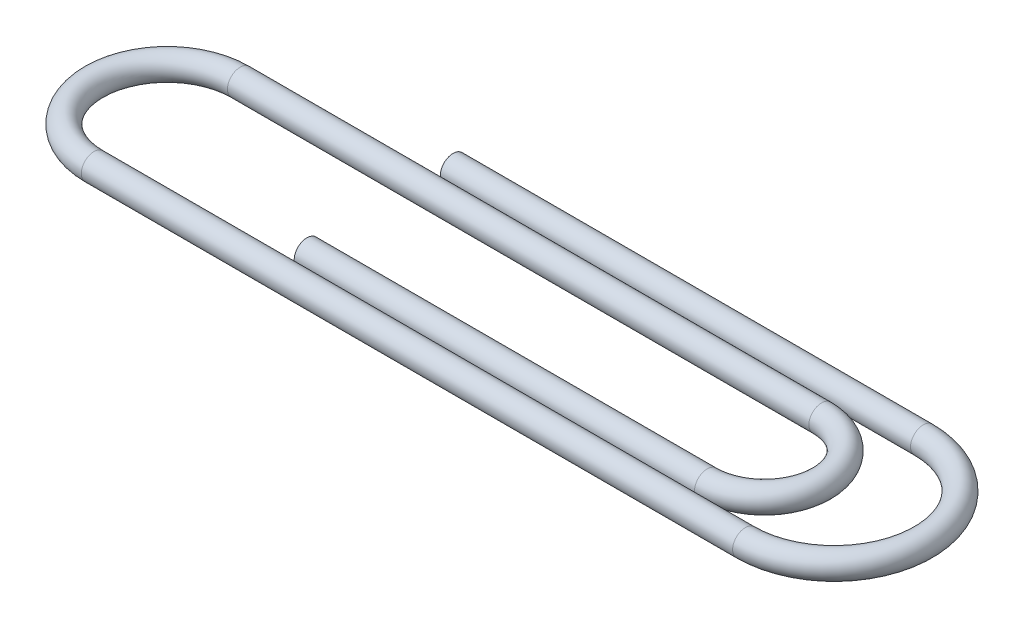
from build123d import *

# Parameters (mm, degrees)
SKETCH2_R = 0.5


with BuildPart() as part:
    # Base-Sweep: sweep along a path in Sketch1
    with BuildLine(Plane(origin=(0, 0, 0), x_dir=(1, 0, 0), z_dir=(0, 1, 0))) as base_sweep_path:
        Line((0, 0), (15.75, 0))
        ThreePointArc((15.75, 0), (18, 2.25), (15.75, 4.5))
        Line((15.75, 4.5), (-7.125, 4.5))
        ThreePointArc((-7.125, 4.5), (-10, 1.625), (-7.125, -1.25))
        Line((-7.125, -1.25), (18.5, -1.25))
        ThreePointArc((18.5, -1.25), (22, 2.25), (18.5, 5.75))
        Line((18.5, 5.75), (0, 5.75))
    # Sketch2 → Base-Sweep (sweep)
    with BuildSketch(Plane(origin=(0, 0, 0), x_dir=(0, 0, -1), z_dir=(1, 0, 0))):
        Circle(SKETCH2_R)
    sweep(path=base_sweep_path.line)


solid = part.part
